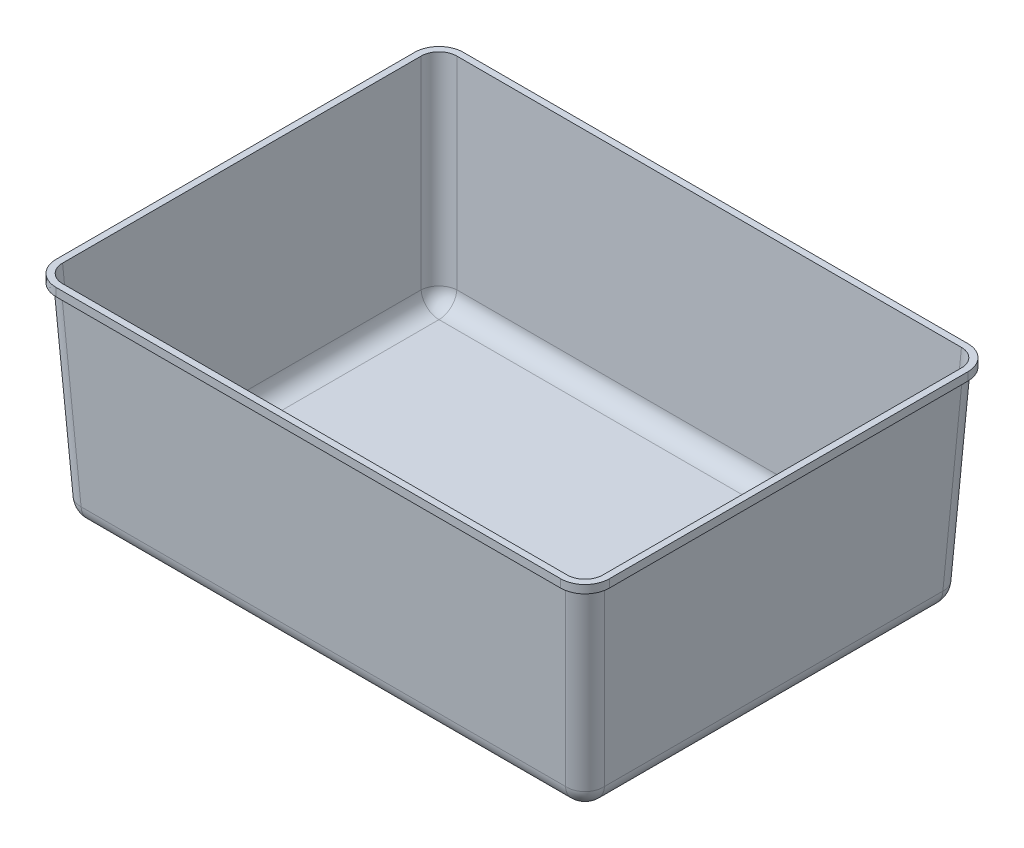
from build123d import *

# Parameters (mm, degrees)
ESQUISSE1_W             = 335
ESQUISSE1_H             = 245
EXTRUSION1_DEPTH        = 130
EXTRUSION1_DRAFT        = -3
CONG_1_R                = 12
COQUE1_T                = -1
EXTRUSION5_DEPTH        = 5
ESQUISSE4_R             = 13.5
ENL_V_MAT_EXTRU_1_DEPTH = 10


with BuildPart() as part:
    # Esquisse1 → Extrusion1 (with draft: the straight prism first)
    with BuildSketch(Plane(origin=(0, 0, 0), x_dir=(1, 0, 0), z_dir=(0, 1, 0))):
        with Locations((167.5, 122.5)):
            Rectangle(ESQUISSE1_W, ESQUISSE1_H)
    extrude(amount=-EXTRUSION1_DEPTH)
    # Extrusion1: the draft: its side faces are tilted about the plane it starts from
    extrusion1_sides = [part.faces().sort_by_distance(p)[0] for p in [
        (167.5, -65, 0),
        (335, -65, -122.5),
        (167.5, -65, -245),
        (0, -65, -122.5),
    ]]
    draft(extrusion1_sides, Plane(origin=(0, 0, 0), x_dir=(1, 0, 0), z_dir=(0, 1, 0)), EXTRUSION1_DRAFT)

    # Cong_1
    cong_1_edges = [part.edges().sort_by_distance(p)[0] for p in [
        (328.186988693, -130, -122.5),
        (167.5, -130, -238.186988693),
        (6.813011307, -130, -122.5),
        (167.5, -130, -6.813011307),
        (3.406505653, -65, -241.593494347),
        (331.593494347, -65, -241.593494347),
        (331.593494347, -65, -3.406505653),
        (3.406505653, -65, -3.406505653),
    ]]
    fillet(cong_1_edges, radius=CONG_1_R)

    # Coque1
    coque1_openings = [part.faces().sort_by_distance(p)[0] for p in [
        (167.5, 0, -122.5),
    ]]
    offset(amount=COQUE1_T, openings=coque1_openings, kind=Kind.INTERSECTION)

    # Esquisse3 → Extrusion5 (add)
    with BuildSketch(Plane(origin=(0, 0, 0), x_dir=(-1, 0, 0), z_dir=(0, 1, 0))):
        with BuildLine():
            Line((-338, -11.983554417), (-338, -233.016445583))
            add(Edge.make_bspline(
                [(-338, -233.016445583), (-338, -234.005600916), (-337.903211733, -234.979959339), (-337.617200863, -236.419967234), (-337.498222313, -236.896355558), (-337.211627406, -237.841696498), (-337.045390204, -238.305655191), (-336.483740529, -239.661187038), (-336.024542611, -240.521556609), (-335.207136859, -241.746386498), (-334.911440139, -242.145360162), (-334.288114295, -242.904878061), (-333.959693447, -243.26702488), (-332.925239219, -244.301766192), (-332.169810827, -244.923628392), (-330.525792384, -246.022635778), (-329.663394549, -246.482464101), (-328.311644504, -247.043088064), (-327.85129729, -247.208283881), (-326.910624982, -247.494318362), (-326.429238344, -247.615119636), (-324.982373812, -247.903206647), (-324.005604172, -248), (-323.016445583, -248)],
                knots=[0, 0, 0, 0, 0.125, 0.125, 0.1875, 0.1875, 0.25, 0.25, 0.375, 0.375, 0.4375, 0.4375, 0.5, 0.5, 0.625, 0.625, 0.75, 0.75, 0.8125, 0.8125, 0.875, 0.875, 1, 1, 1, 1], degree=3))
            Line((-323.016445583, -248), (-11.983554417, -248))
            add(Edge.make_bspline(
                [(-11.983554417, -248), (-10.994399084, -248), (-10.020040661, -247.903211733), (-8.580032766, -247.617200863), (-8.103644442, -247.498222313), (-7.158303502, -247.211627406), (-6.694344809, -247.045390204), (-5.338812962, -246.483740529), (-4.478443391, -246.024542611), (-3.253613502, -245.207136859), (-2.854639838, -244.911440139), (-2.095121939, -244.288114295), (-1.73297512, -243.959693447), (-0.698233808, -242.925239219), (-0.076371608, -242.169810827), (1.022635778, -240.525792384), (1.482464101, -239.663394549), (2.043088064, -238.311644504), (2.208283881, -237.85129729), (2.494318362, -236.910624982), (2.615119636, -236.429238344), (2.903206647, -234.982373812), (3, -234.005604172), (3, -233.016445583)],
                knots=[0, 0, 0, 0, 0.125, 0.125, 0.1875, 0.1875, 0.25, 0.25, 0.375, 0.375, 0.4375, 0.4375, 0.5, 0.5, 0.625, 0.625, 0.75, 0.75, 0.8125, 0.8125, 0.875, 0.875, 1, 1, 1, 1], degree=3))
            Line((3, -233.016445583), (3, -11.983554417))
            add(Edge.make_bspline(
                [(3, -11.983554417), (3, -10.994399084), (2.903211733, -10.020040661), (2.617200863, -8.580032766), (2.498222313, -8.103644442), (2.211627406, -7.158303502), (2.045390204, -6.694344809), (1.483740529, -5.338812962), (1.024542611, -4.478443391), (0.207136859, -3.253613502), (-0.088559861, -2.854639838), (-0.711885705, -2.095121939), (-1.040306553, -1.73297512), (-2.074760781, -0.698233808), (-2.830189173, -0.076371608), (-4.474207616, 1.022635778), (-5.336605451, 1.482464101), (-6.688355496, 2.043088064), (-7.14870271, 2.208283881), (-8.089375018, 2.494318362), (-8.570761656, 2.615119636), (-10.017626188, 2.903206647), (-10.994395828, 3), (-11.983554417, 3)],
                knots=[0, 0, 0, 0, 0.125, 0.125, 0.1875, 0.1875, 0.25, 0.25, 0.375, 0.375, 0.4375, 0.4375, 0.5, 0.5, 0.625, 0.625, 0.75, 0.75, 0.8125, 0.8125, 0.875, 0.875, 1, 1, 1, 1], degree=3))
            Line((-11.983554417, 3), (-323.016445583, 3))
            add(Edge.make_bspline(
                [(-323.016445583, 3), (-324.005600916, 3), (-324.979959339, 2.903211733), (-326.419967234, 2.617200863), (-326.896355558, 2.498222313), (-327.841696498, 2.211627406), (-328.305655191, 2.045390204), (-329.661187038, 1.483740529), (-330.521556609, 1.024542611), (-331.746386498, 0.207136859), (-332.145360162, -0.088559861), (-332.904878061, -0.711885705), (-333.26702488, -1.040306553), (-334.301766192, -2.074760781), (-334.923628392, -2.830189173), (-336.022635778, -4.474207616), (-336.482464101, -5.336605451), (-337.043088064, -6.688355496), (-337.208283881, -7.14870271), (-337.494318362, -8.089375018), (-337.615119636, -8.570761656), (-337.903206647, -10.017626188), (-338, -10.994395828), (-338, -11.983554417)],
                knots=[0, 0, 0, 0, 0.125, 0.125, 0.1875, 0.1875, 0.25, 0.25, 0.375, 0.375, 0.4375, 0.4375, 0.5, 0.5, 0.625, 0.625, 0.75, 0.75, 0.8125, 0.8125, 0.875, 0.875, 1, 1, 1, 1], degree=3))
        make_face()
        with BuildLine():
            Line((-333.998627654, -11.986297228), (-333.998627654, -233.013702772))
            add(Edge.make_bspline(
                [(-333.998627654, -233.013702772), (-333.998627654, -243.998627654), (-323.013702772, -243.998627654)],
                knots=[5.499156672, 5.499156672, 5.499156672, 7.067213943, 7.067213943, 7.067213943], degree=2, weights=[1, 0.70807452, 1]))
            Line((-323.013702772, -243.998627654), (-11.986297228, -243.998627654))
            add(Edge.make_bspline(
                [(-11.986297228, -243.998627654), (-1.001372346, -243.998627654), (-1.001372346, -233.013702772)],
                knots=[2.357564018, 2.357564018, 2.357564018, 3.925621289, 3.925621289, 3.925621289], degree=2, weights=[1, 0.70807452, 1]))
            Line((-1.001372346, -233.013702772), (-1.001372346, -11.986297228))
            add(Edge.make_bspline(
                [(-1.001372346, -11.986297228), (-1.001372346, -1.001372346), (-11.986297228, -1.001372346)],
                knots=[5.499156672, 5.499156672, 5.499156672, 7.067213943, 7.067213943, 7.067213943], degree=2, weights=[1, 0.70807452, 1]))
            Line((-11.986297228, -1.001372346), (-323.013702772, -1.001372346))
            add(Edge.make_bspline(
                [(-323.013702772, -1.001372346), (-333.998627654, -1.001372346), (-333.998627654, -11.986297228)],
                knots=[2.357564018, 2.357564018, 2.357564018, 3.925621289, 3.925621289, 3.925621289], degree=2, weights=[1, 0.70807452, 1]))
        make_face(mode=Mode.SUBTRACT)
    extrude(amount=-EXTRUSION5_DEPTH)

    # Esquisse4 → Enl_v. mat.-Extru.1 (cut)
    with BuildSketch(Plane.XZ.offset(130)):
        with Locations(Location((266.799413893, -176.799413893, 0), (0, 0, 270))):
            Circle(ESQUISSE4_R)
    extrude(amount=-ENL_V_MAT_EXTRU_1_DEPTH, mode=Mode.SUBTRACT)


solid = part.part
